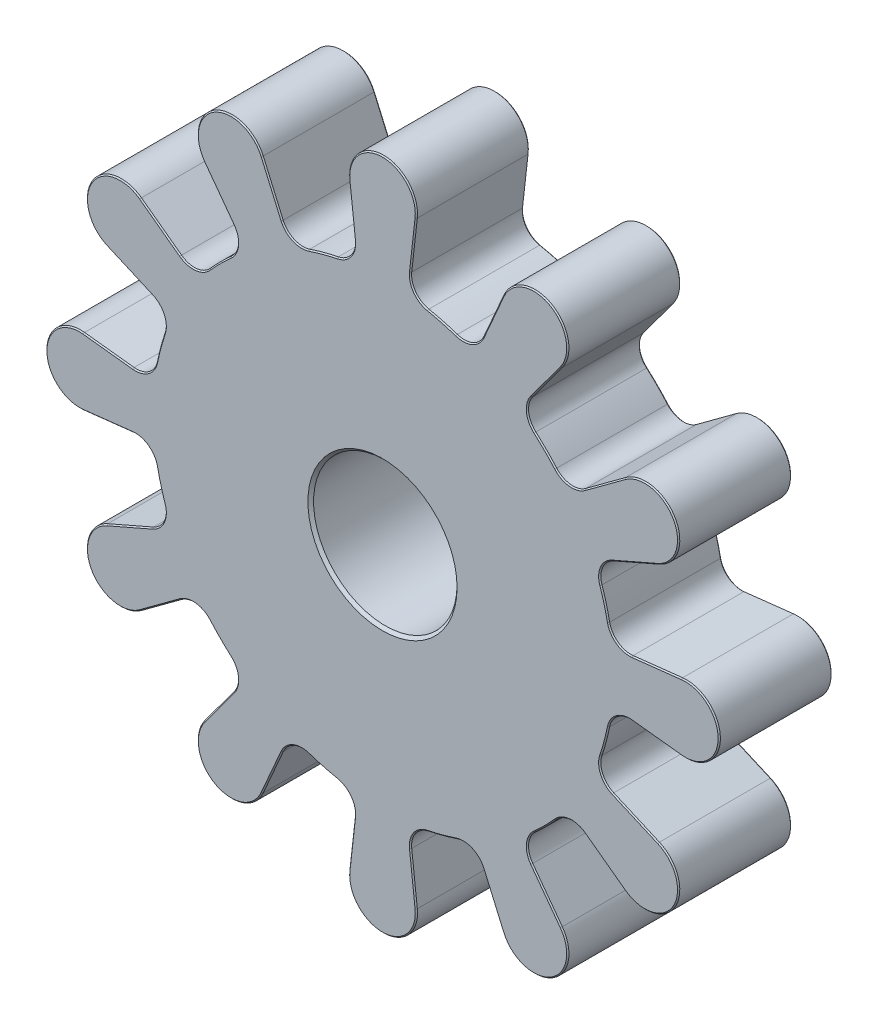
from build123d import *

# Parameters (mm, degrees)
SKETCH_1_R      = 6.35
EXTRUDE_1_DEPTH = 10
CHAMFER_1_SIZE  = 0.25
CHAMFER_2_SIZE  = 0.1


with BuildPart() as part:
    # Sketch 1 → Extrude 1 (new body)
    with BuildSketch(Plane.XY):
        with BuildLine():
            Line((-2.487705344, 22.083824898), (-2.981144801, 26.464179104))
            ThreePointArc((-2.981144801, 26.464179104), (0, 29.8), (2.981144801, 26.464179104))
            Line((2.981144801, 26.464179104), (2.487705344, 22.083824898))
            ThreePointArc((2.487705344, 22.083824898), (2.841964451, 20.747538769), (4.006587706, 20.002681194))
            ThreePointArc((4.006587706, 20.002681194), (5.27990852, 19.704886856), (6.531533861, 19.326123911))
            ThreePointArc((6.531533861, 19.326123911), (7.912555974, 19.388877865), (8.887496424, 20.369006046))
            Line((8.887496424, 20.369006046), (10.650342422, 24.409223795))
            ThreePointArc((10.650342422, 24.409223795), (14.9, 25.807557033), (15.813836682, 21.428078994))
            Line((15.813836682, 21.428078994), (13.196328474, 17.881300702))
            ThreePointArc((13.196328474, 17.881300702), (12.834982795, 16.546913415), (13.471147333, 15.319536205))
            ThreePointArc((13.471147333, 15.319536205), (14.424978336, 14.424978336), (15.319536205, 13.471147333))
            ThreePointArc((15.319536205, 13.471147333), (16.546913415, 12.834982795), (17.881300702, 13.196328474))
            Line((17.881300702, 13.196328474), (21.428078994, 15.813836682))
            ThreePointArc((21.428078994, 15.813836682), (25.807557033, 14.9), (24.409223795, 10.650342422))
            Line((24.409223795, 10.650342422), (20.369006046, 8.887496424))
            ThreePointArc((20.369006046, 8.887496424), (19.388877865, 7.912555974), (19.326123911, 6.531533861))
            ThreePointArc((19.326123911, 6.531533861), (19.704886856, 5.27990852), (20.002681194, 4.006587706))
            ThreePointArc((20.002681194, 4.006587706), (20.747538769, 2.841964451), (22.083824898, 2.487705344))
            Line((22.083824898, 2.487705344), (26.464179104, 2.981144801))
            ThreePointArc((26.464179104, 2.981144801), (29.8, 0), (26.464179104, -2.981144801))
            Line((26.464179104, -2.981144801), (22.083824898, -2.487705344))
            ThreePointArc((22.083824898, -2.487705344), (20.747538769, -2.841964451), (20.002681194, -4.006587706))
            ThreePointArc((20.002681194, -4.006587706), (19.704886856, -5.27990852), (19.326123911, -6.531533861))
            ThreePointArc((19.326123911, -6.531533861), (19.388877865, -7.912555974), (20.369006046, -8.887496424))
            Line((20.369006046, -8.887496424), (24.409223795, -10.650342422))
            ThreePointArc((24.409223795, -10.650342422), (25.807557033, -14.9), (21.428078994, -15.813836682))
            Line((21.428078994, -15.813836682), (17.881300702, -13.196328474))
            ThreePointArc((17.881300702, -13.196328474), (16.546913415, -12.834982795), (15.319536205, -13.471147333))
            ThreePointArc((15.319536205, -13.471147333), (14.424978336, -14.424978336), (13.471147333, -15.319536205))
            ThreePointArc((13.471147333, -15.319536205), (12.834982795, -16.546913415), (13.196328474, -17.881300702))
            Line((13.196328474, -17.881300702), (15.813836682, -21.428078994))
            ThreePointArc((15.813836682, -21.428078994), (14.9, -25.807557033), (10.650342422, -24.409223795))
            Line((10.650342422, -24.409223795), (8.887496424, -20.369006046))
            ThreePointArc((8.887496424, -20.369006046), (7.912555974, -19.388877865), (6.531533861, -19.326123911))
            ThreePointArc((6.531533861, -19.326123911), (5.27990852, -19.704886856), (4.006587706, -20.002681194))
            ThreePointArc((4.006587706, -20.002681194), (2.841964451, -20.747538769), (2.487705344, -22.083824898))
            Line((2.487705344, -22.083824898), (2.981144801, -26.464179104))
            ThreePointArc((2.981144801, -26.464179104), (0, -29.8), (-2.981144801, -26.464179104))
            Line((-2.981144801, -26.464179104), (-2.487705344, -22.083824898))
            ThreePointArc((-2.487705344, -22.083824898), (-2.841964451, -20.747538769), (-4.006587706, -20.002681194))
            ThreePointArc((-4.006587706, -20.002681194), (-5.27990852, -19.704886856), (-6.531533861, -19.326123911))
            ThreePointArc((-6.531533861, -19.326123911), (-7.912555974, -19.388877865), (-8.887496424, -20.369006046))
            Line((-8.887496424, -20.369006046), (-10.650342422, -24.409223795))
            ThreePointArc((-10.650342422, -24.409223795), (-14.9, -25.807557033), (-15.813836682, -21.428078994))
            Line((-15.813836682, -21.428078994), (-13.196328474, -17.881300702))
            ThreePointArc((-13.196328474, -17.881300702), (-12.834982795, -16.546913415), (-13.471147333, -15.319536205))
            ThreePointArc((-13.471147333, -15.319536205), (-14.424978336, -14.424978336), (-15.319536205, -13.471147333))
            ThreePointArc((-15.319536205, -13.471147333), (-16.546913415, -12.834982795), (-17.881300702, -13.196328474))
            Line((-17.881300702, -13.196328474), (-21.428078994, -15.813836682))
            ThreePointArc((-21.428078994, -15.813836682), (-25.807557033, -14.9), (-24.409223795, -10.650342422))
            Line((-24.409223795, -10.650342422), (-20.369006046, -8.887496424))
            ThreePointArc((-20.369006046, -8.887496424), (-19.388877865, -7.912555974), (-19.326123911, -6.531533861))
            ThreePointArc((-19.326123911, -6.531533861), (-19.704886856, -5.27990852), (-20.002681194, -4.006587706))
            ThreePointArc((-20.002681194, -4.006587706), (-20.747538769, -2.841964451), (-22.083824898, -2.487705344))
            Line((-22.083824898, -2.487705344), (-26.464179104, -2.981144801))
            ThreePointArc((-26.464179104, -2.981144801), (-29.8, 0), (-26.464179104, 2.981144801))
            Line((-26.464179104, 2.981144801), (-22.083824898, 2.487705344))
            ThreePointArc((-22.083824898, 2.487705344), (-20.747538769, 2.841964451), (-20.002681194, 4.006587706))
            ThreePointArc((-20.002681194, 4.006587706), (-19.704886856, 5.27990852), (-19.326123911, 6.531533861))
            ThreePointArc((-19.326123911, 6.531533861), (-19.388877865, 7.912555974), (-20.369006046, 8.887496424))
            Line((-20.369006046, 8.887496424), (-24.409223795, 10.650342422))
            ThreePointArc((-24.409223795, 10.650342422), (-25.807557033, 14.9), (-21.428078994, 15.813836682))
            Line((-21.428078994, 15.813836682), (-17.881300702, 13.196328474))
            ThreePointArc((-17.881300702, 13.196328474), (-16.546913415, 12.834982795), (-15.319536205, 13.471147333))
            ThreePointArc((-15.319536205, 13.471147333), (-14.424978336, 14.424978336), (-13.471147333, 15.319536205))
            ThreePointArc((-13.471147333, 15.319536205), (-12.834982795, 16.546913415), (-13.196328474, 17.881300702))
            Line((-13.196328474, 17.881300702), (-15.813836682, 21.428078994))
            ThreePointArc((-15.813836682, 21.428078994), (-14.9, 25.807557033), (-10.650342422, 24.409223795))
            Line((-10.650342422, 24.409223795), (-8.887496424, 20.369006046))
            ThreePointArc((-8.887496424, 20.369006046), (-7.912555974, 19.388877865), (-6.531533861, 19.326123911))
            ThreePointArc((-6.531533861, 19.326123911), (-5.27990852, 19.704886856), (-4.006587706, 20.002681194))
            ThreePointArc((-4.006587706, 20.002681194), (-2.841964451, 20.747538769), (-2.487705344, 22.083824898))
        make_face()
        Circle(SKETCH_1_R, mode=Mode.SUBTRACT)
    extrude(amount=EXTRUDE_1_DEPTH)

    # Chamfer 1
    chamfer_1_edges = [part.edges().sort_by_distance(p)[0] for p in [
        (-6.35, 0, 0),
        (-6.35, 0, 10),
    ]]
    chamfer(chamfer_1_edges, length=CHAMFER_1_SIZE)

    # Chamfer 2
    chamfer_2_edges = [part.edges().sort_by_distance(p)[0] for p in [
        (-2.841964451, 20.747538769, 10),
        (-7.912555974, -19.388877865, 10),
        (-5.27990852, -19.704886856, 10),
        (-2.841964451, -20.747538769, 10),
        (-2.734425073, -24.274002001, 10),
        (0, -29.8, 10),
        (2.734425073, -24.274002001, 10),
        (2.841964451, -20.747538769, 10),
        (5.27990852, -19.704886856, 10),
        (7.912555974, -19.388877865, 10),
        (9.768919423, -22.389114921, 10),
        (-5.27990852, 19.704886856, 10),
        (14.9, -25.807557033, 10),
        (14.505082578, -19.654689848, 10),
        (12.834982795, -16.546913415, 10),
        (14.424978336, -14.424978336, 10),
        (16.546913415, -12.834982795, 10),
        (19.654689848, -14.505082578, 10),
        (25.807557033, -14.9, 10),
        (22.389114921, -9.768919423, 10),
        (19.388877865, -7.912555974, 10),
        (19.704886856, -5.27990852, 10),
        (-7.912555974, 19.388877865, 10),
        (20.747538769, -2.841964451, 10),
        (24.274002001, -2.734425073, 10),
        (29.8, 0, 10),
        (24.274002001, 2.734425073, 10),
        (20.747538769, 2.841964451, 10),
        (19.704886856, 5.27990852, 10),
        (19.388877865, 7.912555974, 10),
        (22.389114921, 9.768919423, 10),
        (25.807557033, 14.9, 10),
        (19.654689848, 14.505082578, 10),
        (-9.768919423, 22.389114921, 10),
        (16.546913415, 12.834982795, 10),
        (14.424978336, 14.424978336, 10),
        (12.834982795, 16.546913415, 10),
        (14.505082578, 19.654689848, 10),
        (14.9, 25.807557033, 10),
        (9.768919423, 22.389114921, 10),
        (7.912555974, 19.388877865, 10),
        (5.27990852, 19.704886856, 10),
        (2.841964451, 20.747538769, 10),
        (2.734425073, 24.274002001, 10),
        (-14.9, 25.807557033, 10),
        (-14.505082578, 19.654689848, 10),
        (-12.834982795, 16.546913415, 10),
        (-14.424978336, 14.424978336, 10),
        (-16.546913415, 12.834982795, 10),
        (-19.654689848, 14.505082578, 10),
        (0, 29.8, 10),
        (-25.807557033, 14.9, 10),
        (-22.389114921, 9.768919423, 10),
        (-19.388877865, 7.912555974, 10),
        (-19.704886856, 5.27990852, 10),
        (-20.747538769, 2.841964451, 10),
        (-24.274002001, 2.734425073, 10),
        (-29.8, 0, 10),
        (2.734425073, 24.274002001, 0),
        (2.841964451, 20.747538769, 0),
        (5.27990852, 19.704886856, 0),
        (7.912555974, 19.388877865, 0),
        (9.768919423, 22.389114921, 0),
        (14.9, 25.807557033, 0),
        (-24.274002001, -2.734425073, 10),
        (14.505082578, 19.654689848, 0),
        (12.834982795, 16.546913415, 0),
        (14.424978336, 14.424978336, 0),
        (16.546913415, 12.834982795, 0),
        (19.654689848, 14.505082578, 0),
        (25.807557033, 14.9, 0),
        (22.389114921, 9.768919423, 0),
        (-20.747538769, -2.841964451, 10),
        (19.388877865, 7.912555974, 0),
        (19.704886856, 5.27990852, 0),
        (20.747538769, 2.841964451, 0),
        (24.274002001, 2.734425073, 0),
        (29.8, 0, 0),
        (24.274002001, -2.734425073, 0),
        (20.747538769, -2.841964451, 0),
        (19.704886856, -5.27990852, 0),
        (-19.704886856, -5.27990852, 10),
        (19.388877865, -7.912555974, 0),
        (22.389114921, -9.768919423, 0),
        (25.807557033, -14.9, 0),
        (19.654689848, -14.505082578, 0),
        (16.546913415, -12.834982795, 0),
        (14.424978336, -14.424978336, 0),
        (12.834982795, -16.546913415, 0),
        (-2.734425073, 24.274002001, 10),
        (-19.388877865, -7.912555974, 10),
        (14.505082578, -19.654689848, 0),
        (14.9, -25.807557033, 0),
        (9.768919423, -22.389114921, 0),
        (7.912555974, -19.388877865, 0),
        (5.27990852, -19.704886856, 0),
        (2.841964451, -20.747538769, 0),
        (2.734425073, -24.274002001, 0),
        (0, -29.8, 0),
        (-22.389114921, -9.768919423, 10),
        (-2.734425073, -24.274002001, 0),
        (-2.841964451, -20.747538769, 0),
        (-5.27990852, -19.704886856, 0),
        (-7.912555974, -19.388877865, 0),
        (-9.768919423, -22.389114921, 0),
        (-14.9, -25.807557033, 0),
        (-14.505082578, -19.654689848, 0),
        (-25.807557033, -14.9, 10),
        (-12.834982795, -16.546913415, 0),
        (-14.424978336, -14.424978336, 0),
        (-16.546913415, -12.834982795, 0),
        (-19.654689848, -14.505082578, 0),
        (-25.807557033, -14.9, 0),
        (-22.389114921, -9.768919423, 0),
        (-19.388877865, -7.912555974, 0),
        (-19.704886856, -5.27990852, 0),
        (-19.654689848, -14.505082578, 10),
        (-20.747538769, -2.841964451, 0),
        (-24.274002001, -2.734425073, 0),
        (-29.8, 0, 0),
        (-24.274002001, 2.734425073, 0),
        (-20.747538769, 2.841964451, 0),
        (-19.704886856, 5.27990852, 0),
        (-19.388877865, 7.912555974, 0),
        (-16.546913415, -12.834982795, 10),
        (-22.389114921, 9.768919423, 0),
        (-25.807557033, 14.9, 0),
        (-19.654689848, 14.505082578, 0),
        (-16.546913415, 12.834982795, 0),
        (-14.424978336, 14.424978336, 0),
        (-12.834982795, 16.546913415, 0),
        (-14.505082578, 19.654689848, 0),
        (-14.9, 25.807557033, 0),
        (-14.424978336, -14.424978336, 10),
        (-9.768919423, 22.389114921, 0),
        (-7.912555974, 19.388877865, 0),
        (-5.27990852, 19.704886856, 0),
        (-2.841964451, 20.747538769, 0),
        (-2.734425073, 24.274002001, 0),
        (0, 29.8, 0),
        (-12.834982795, -16.546913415, 10),
        (-14.505082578, -19.654689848, 10),
        (-14.9, -25.807557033, 10),
        (-9.768919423, -22.389114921, 10),
    ]]
    chamfer(chamfer_2_edges, length=CHAMFER_2_SIZE)


solid = part.part
